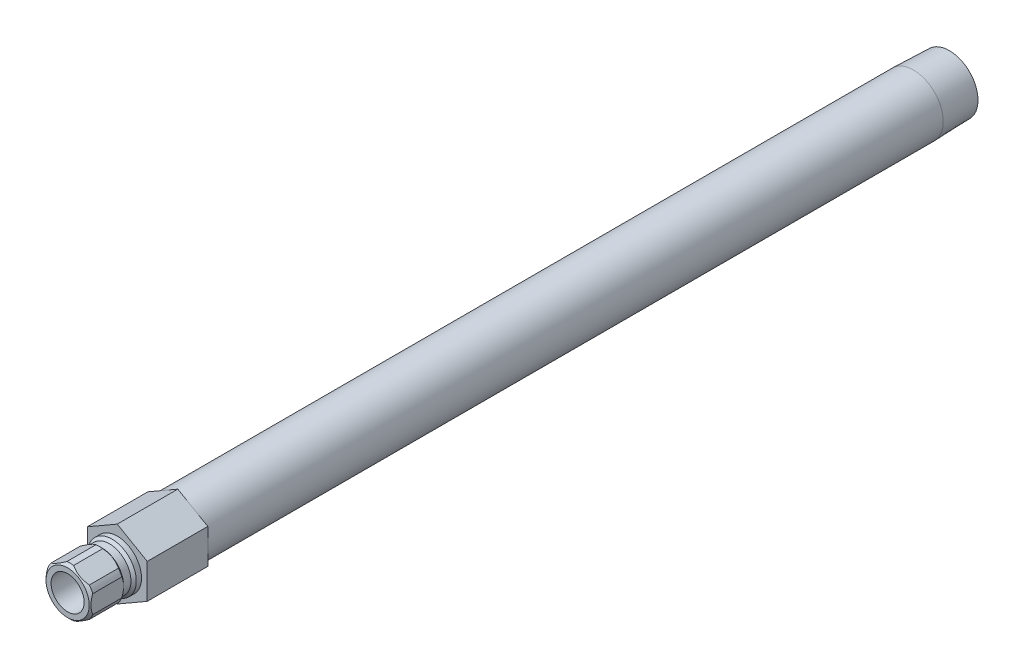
ISO-10303-21;
HEADER;
FILE_DESCRIPTION(('STEP AP214'),'2;1');
FILE_NAME('part.step','',(''),(''),'','','');
FILE_SCHEMA(('AUTOMOTIVE_DESIGN { 1 0 10303 214 1 1 1 1 }'));
ENDSEC;
DATA;
#1=APPLICATION_CONTEXT('core data for automotive mechanical design processes');
#2=APPLICATION_PROTOCOL_DEFINITION('international standard','automotive_design',2000,#1);
#3=PRODUCT_CONTEXT('',#1,'mechanical');
#4=PRODUCT('Part','Part','',(#3));
#5=PRODUCT_RELATED_PRODUCT_CATEGORY('part','',(#4));
#6=PRODUCT_DEFINITION_FORMATION('','',#4);
#7=PRODUCT_DEFINITION_CONTEXT('part definition',#1,'design');
#8=PRODUCT_DEFINITION('design','',#6,#7);
#9=PRODUCT_DEFINITION_SHAPE('','',#8);
#10=(LENGTH_UNIT() NAMED_UNIT(*) SI_UNIT(.MILLI.,.METRE.));
#11=(NAMED_UNIT(*) PLANE_ANGLE_UNIT() SI_UNIT($,.RADIAN.));
#12=(NAMED_UNIT(*) SI_UNIT($,.STERADIAN.) SOLID_ANGLE_UNIT());
#13=UNCERTAINTY_MEASURE_WITH_UNIT(LENGTH_MEASURE(1.E-05),#10,'distance_accuracy_value','');
#14=(GEOMETRIC_REPRESENTATION_CONTEXT(3) GLOBAL_UNCERTAINTY_ASSIGNED_CONTEXT((#13)) GLOBAL_UNIT_ASSIGNED_CONTEXT((#10,
#11,#12)) REPRESENTATION_CONTEXT('',''));
#15=CARTESIAN_POINT('',(0.,0.,0.));
#16=DIRECTION('',(0.,0.,1.));
#17=DIRECTION('',(1.,0.,0.));
#18=AXIS2_PLACEMENT_3D('',#15,#16,#17);
#19=CARTESIAN_POINT('',(0.,0.,0.));
#20=DIRECTION('',(0.,0.,-1.));
#21=DIRECTION('',(0.,1.,0.));
#22=AXIS2_PLACEMENT_3D('',#19,#20,#21);
#23=CYLINDRICAL_SURFACE('',#22,6.985);
#24=DIRECTION('',(0.,0.,-1.));
#25=VECTOR('',#24,1.);
#26=CARTESIAN_POINT('',(5.50323442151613,-4.30170151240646,0.));
#27=LINE('',#26,#25);
#28=CARTESIAN_POINT('',(5.50323442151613,-4.30170151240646,5.1562));
#29=VERTEX_POINT('',#28);
#30=CARTESIAN_POINT('',(5.50323442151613,-4.30170151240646,13.5382));
#31=VERTEX_POINT('',#30);
#32=EDGE_CURVE('E406',#29,#31,#27,.F.);
#33=ORIENTED_EDGE('',*,*,#32,.F.);
#34=CARTESIAN_POINT('',(0.,0.,5.1562));
#35=DIRECTION('',(0.,0.,-1.));
#36=DIRECTION('',(0.,1.,0.));
#37=AXIS2_PLACEMENT_3D('',#34,#35,#36);
#38=CIRCLE('',#37,6.985);
#39=CARTESIAN_POINT('',(6.477,-2.6150900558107,5.1562));
#40=VERTEX_POINT('',#39);
#41=EDGE_CURVE('E383',#40,#29,#38,.T.);
#42=ORIENTED_EDGE('',*,*,#41,.F.);
#43=DIRECTION('',(0.,0.,-1.));
#44=VECTOR('',#43,1.);
#45=CARTESIAN_POINT('',(6.477,-2.6150900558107,0.));
#46=LINE('',#45,#44);
#47=CARTESIAN_POINT('',(6.477,-2.6150900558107,13.5382));
#48=VERTEX_POINT('',#47);
#49=EDGE_CURVE('E397',#48,#40,#46,.T.);
#50=ORIENTED_EDGE('',*,*,#49,.F.);
#51=CARTESIAN_POINT('',(0.,0.,13.5382));
#52=DIRECTION('',(0.,0.,-1.));
#53=DIRECTION('',(0.,1.,0.));
#54=AXIS2_PLACEMENT_3D('',#51,#52,#53);
#55=CIRCLE('',#54,6.985);
#56=EDGE_CURVE('E191',#48,#31,#55,.T.);
#57=ORIENTED_EDGE('',*,*,#56,.T.);
#58=EDGE_LOOP('',(#33,#42,#50,#57));
#59=FACE_BOUND('',#58,.T.);
#60=ADVANCED_FACE('F34',(#59),#23,.T.);
#61=DIRECTION('',(0.,0.,-1.));
#62=VECTOR('',#61,1.);
#63=CARTESIAN_POINT('',(6.477,2.61509005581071,0.));
#64=LINE('',#63,#62);
#65=CARTESIAN_POINT('',(6.477,2.6150900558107,5.1562));
#66=VERTEX_POINT('',#65);
#67=CARTESIAN_POINT('',(6.477,2.61509005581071,13.5382));
#68=VERTEX_POINT('',#67);
#69=EDGE_CURVE('E309',#66,#68,#64,.F.);
#70=ORIENTED_EDGE('',*,*,#69,.F.);
#71=CARTESIAN_POINT('',(5.50323442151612,4.30170151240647,5.1562));
#72=VERTEX_POINT('',#71);
#73=EDGE_CURVE('E204',#72,#66,#38,.T.);
#74=ORIENTED_EDGE('',*,*,#73,.F.);
#75=DIRECTION('',(0.,0.,-1.));
#76=VECTOR('',#75,1.);
#77=CARTESIAN_POINT('',(5.50323442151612,4.30170151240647,0.));
#78=LINE('',#77,#76);
#79=CARTESIAN_POINT('',(5.50323442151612,4.30170151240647,13.5382));
#80=VERTEX_POINT('',#79);
#81=EDGE_CURVE('E394',#80,#72,#78,.T.);
#82=ORIENTED_EDGE('',*,*,#81,.F.);
#83=EDGE_CURVE('E198',#80,#68,#55,.T.);
#84=ORIENTED_EDGE('',*,*,#83,.T.);
#85=EDGE_LOOP('',(#70,#74,#82,#84));
#86=FACE_BOUND('',#85,.T.);
#87=ADVANCED_FACE('F343',(#86),#23,.T.);
#88=DIRECTION('',(0.,0.,-1.));
#89=VECTOR('',#88,1.);
#90=CARTESIAN_POINT('',(0.973765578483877,6.91679156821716,0.));
#91=LINE('',#90,#89);
#92=CARTESIAN_POINT('',(0.973765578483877,6.91679156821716,5.1562));
#93=VERTEX_POINT('',#92);
#94=CARTESIAN_POINT('',(0.973765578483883,6.91679156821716,13.5382));
#95=VERTEX_POINT('',#94);
#96=EDGE_CURVE('E399',#93,#95,#91,.F.);
#97=ORIENTED_EDGE('',*,*,#96,.F.);
#98=CARTESIAN_POINT('',(-0.973765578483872,6.91679156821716,5.1562));
#99=VERTEX_POINT('',#98);
#100=EDGE_CURVE('E200',#99,#93,#38,.T.);
#101=ORIENTED_EDGE('',*,*,#100,.F.);
#102=DIRECTION('',(0.,0.,-1.));
#103=VECTOR('',#102,1.);
#104=CARTESIAN_POINT('',(-0.973765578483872,6.91679156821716,0.));
#105=LINE('',#104,#103);
#106=CARTESIAN_POINT('',(-0.973765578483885,6.91679156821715,13.5382));
#107=VERTEX_POINT('',#106);
#108=EDGE_CURVE('E375',#107,#99,#105,.T.);
#109=ORIENTED_EDGE('',*,*,#108,.F.);
#110=EDGE_CURVE('E193',#107,#95,#55,.T.);
#111=ORIENTED_EDGE('',*,*,#110,.T.);
#112=EDGE_LOOP('',(#97,#101,#109,#111));
#113=FACE_BOUND('',#112,.T.);
#114=ADVANCED_FACE('F348',(#113),#23,.T.);
#115=DIRECTION('',(0.,0.,-1.));
#116=VECTOR('',#115,1.);
#117=CARTESIAN_POINT('',(-5.50323442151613,4.30170151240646,0.));
#118=LINE('',#117,#116);
#119=CARTESIAN_POINT('',(-5.50323442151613,4.30170151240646,5.1562));
#120=VERTEX_POINT('',#119);
#121=CARTESIAN_POINT('',(-5.50323442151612,4.30170151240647,13.5382));
#122=VERTEX_POINT('',#121);
#123=EDGE_CURVE('E54',#120,#122,#118,.F.);
#124=ORIENTED_EDGE('',*,*,#123,.F.);
#125=CARTESIAN_POINT('',(-6.477,2.61509005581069,5.1562));
#126=VERTEX_POINT('',#125);
#127=EDGE_CURVE('E203',#126,#120,#38,.T.);
#128=ORIENTED_EDGE('',*,*,#127,.F.);
#129=DIRECTION('',(0.,0.,-1.));
#130=VECTOR('',#129,1.);
#131=CARTESIAN_POINT('',(-6.477,2.61509005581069,0.));
#132=LINE('',#131,#130);
#133=CARTESIAN_POINT('',(-6.477,2.61509005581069,13.5382));
#134=VERTEX_POINT('',#133);
#135=EDGE_CURVE('E263',#134,#126,#132,.T.);
#136=ORIENTED_EDGE('',*,*,#135,.F.);
#137=EDGE_CURVE('E189',#134,#122,#55,.T.);
#138=ORIENTED_EDGE('',*,*,#137,.T.);
#139=EDGE_LOOP('',(#124,#128,#136,#138));
#140=FACE_BOUND('',#139,.T.);
#141=ADVANCED_FACE('F360',(#140),#23,.T.);
#142=DIRECTION('',(0.,0.,-1.));
#143=VECTOR('',#142,1.);
#144=CARTESIAN_POINT('',(-6.477,-2.61509005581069,0.));
#145=LINE('',#144,#143);
#146=CARTESIAN_POINT('',(-6.477,-2.61509005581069,5.1562));
#147=VERTEX_POINT('',#146);
#148=CARTESIAN_POINT('',(-6.477,-2.6150900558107,13.5382));
#149=VERTEX_POINT('',#148);
#150=EDGE_CURVE('E62',#147,#149,#145,.F.);
#151=ORIENTED_EDGE('',*,*,#150,.F.);
#152=CARTESIAN_POINT('',(-5.50323442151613,-4.30170151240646,5.1562));
#153=VERTEX_POINT('',#152);
#154=EDGE_CURVE('E182',#153,#147,#38,.T.);
#155=ORIENTED_EDGE('',*,*,#154,.F.);
#156=DIRECTION('',(0.,0.,-1.));
#157=VECTOR('',#156,1.);
#158=CARTESIAN_POINT('',(-5.50323442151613,-4.30170151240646,0.));
#159=LINE('',#158,#157);
#160=CARTESIAN_POINT('',(-5.50323442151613,-4.30170151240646,13.5382));
#161=VERTEX_POINT('',#160);
#162=EDGE_CURVE('E165',#161,#153,#159,.T.);
#163=ORIENTED_EDGE('',*,*,#162,.F.);
#164=EDGE_CURVE('E180',#161,#149,#55,.T.);
#165=ORIENTED_EDGE('',*,*,#164,.T.);
#166=EDGE_LOOP('',(#151,#155,#163,#165));
#167=FACE_BOUND('',#166,.T.);
#168=ADVANCED_FACE('F179',(#167),#23,.T.);
#169=CARTESIAN_POINT('',(0.,0.,0.));
#170=DIRECTION('',(0.,0.,-1.));
#171=DIRECTION('',(0.,1.,0.));
#172=AXIS2_PLACEMENT_3D('',#169,#170,#171);
#173=CYLINDRICAL_SURFACE('',#172,8.57249999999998);
#174=CARTESIAN_POINT('',(0.,0.,-229.362));
#175=DIRECTION('',(0.,0.,-1.));
#176=DIRECTION('',(0.,1.,0.));
#177=AXIS2_PLACEMENT_3D('',#174,#175,#176);
#178=CIRCLE('',#177,8.57249999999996);
#179=CARTESIAN_POINT('',(0.,8.5725,-229.362));
#180=VERTEX_POINT('',#179);
#181=EDGE_CURVE('E214',#180,#180,#178,.T.);
#182=ORIENTED_EDGE('',*,*,#181,.F.);
#183=EDGE_LOOP('',(#182));
#184=FACE_BOUND('',#183,.T.);
#185=CARTESIAN_POINT('',(0.,0.,-17.4498));
#186=DIRECTION('',(0.,0.,1.));
#187=DIRECTION('',(1.,0.,0.));
#188=AXIS2_PLACEMENT_3D('',#185,#186,#187);
#189=CIRCLE('',#188,8.57249999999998);
#190=CARTESIAN_POINT('',(8.57249999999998,0.,-17.4498));
#191=VERTEX_POINT('',#190);
#192=EDGE_CURVE('E231',#191,#191,#189,.F.);
#193=ORIENTED_EDGE('',*,*,#192,.T.);
#194=EDGE_LOOP('',(#193));
#195=FACE_BOUND('',#194,.T.);
#196=ADVANCED_FACE('F359',(#184,#195),#173,.T.);
#197=CARTESIAN_POINT('',(0.,0.,0.));
#198=DIRECTION('',(0.,0.,-1.));
#199=DIRECTION('',(0.,1.,0.));
#200=AXIS2_PLACEMENT_3D('',#197,#198,#199);
#201=CYLINDRICAL_SURFACE('',#200,4.76249999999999);
#202=CARTESIAN_POINT('',(0.,0.,14.3002));
#203=DIRECTION('',(0.,0.,-1.));
#204=DIRECTION('',(0.,1.,0.));
#205=AXIS2_PLACEMENT_3D('',#202,#203,#204);
#206=CIRCLE('',#205,4.7625);
#207=CARTESIAN_POINT('',(0.,4.7625,14.3002));
#208=VERTEX_POINT('',#207);
#209=EDGE_CURVE('E233',#208,#208,#206,.T.);
#210=ORIENTED_EDGE('',*,*,#209,.F.);
#211=EDGE_LOOP('',(#210));
#212=FACE_BOUND('',#211,.T.);
#213=CARTESIAN_POINT('',(0.,0.,-17.4498));
#214=DIRECTION('',(0.,0.,-1.));
#215=DIRECTION('',(0.,1.,0.));
#216=AXIS2_PLACEMENT_3D('',#213,#214,#215);
#217=CIRCLE('',#216,4.76249999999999);
#218=CARTESIAN_POINT('',(0.,4.7625,-17.4498));
#219=VERTEX_POINT('',#218);
#220=EDGE_CURVE('E226',#219,#219,#217,.T.);
#221=ORIENTED_EDGE('',*,*,#220,.T.);
#222=EDGE_LOOP('',(#221));
#223=FACE_BOUND('',#222,.T.);
#224=ADVANCED_FACE('F36',(#212,#223),#201,.F.);
#225=CARTESIAN_POINT('',(0.,4.7625,-17.4498));
#226=DIRECTION('',(0.,0.,-1.));
#227=DIRECTION('',(0.,1.,0.));
#228=AXIS2_PLACEMENT_3D('',#225,#226,#227);
#229=PLANE('',#228);
#230=CARTESIAN_POINT('',(0.,0.,-17.4498));
#231=DIRECTION('',(0.,0.,-1.));
#232=DIRECTION('',(0.,1.,0.));
#233=AXIS2_PLACEMENT_3D('',#230,#231,#232);
#234=CIRCLE('',#233,6.26109999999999);
#235=CARTESIAN_POINT('',(0.,6.2611,-17.4498));
#236=VERTEX_POINT('',#235);
#237=EDGE_CURVE('E223',#236,#236,#234,.T.);
#238=ORIENTED_EDGE('',*,*,#237,.T.);
#239=EDGE_LOOP('',(#238));
#240=FACE_BOUND('',#239,.T.);
#241=ORIENTED_EDGE('',*,*,#220,.F.);
#242=EDGE_LOOP('',(#241));
#243=FACE_BOUND('',#242,.T.);
#244=ADVANCED_FACE('F687',(#240,#243),#229,.T.);
#245=CARTESIAN_POINT('',(0.,0.,0.));
#246=DIRECTION('',(0.,0.,-1.));
#247=DIRECTION('',(0.,1.,0.));
#248=AXIS2_PLACEMENT_3D('',#245,#246,#247);
#249=CYLINDRICAL_SURFACE('',#248,6.26109999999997);
#250=CARTESIAN_POINT('',(0.,0.,-239.6998));
#251=DIRECTION('',(0.,0.,-1.));
#252=DIRECTION('',(0.,1.,0.));
#253=AXIS2_PLACEMENT_3D('',#250,#251,#252);
#254=CIRCLE('',#253,6.26109999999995);
#255=CARTESIAN_POINT('',(0.,6.2611,-239.6998));
#256=VERTEX_POINT('',#255);
#257=EDGE_CURVE('E220',#256,#256,#254,.T.);
#258=ORIENTED_EDGE('',*,*,#257,.T.);
#259=EDGE_LOOP('',(#258));
#260=FACE_BOUND('',#259,.T.);
#261=ORIENTED_EDGE('',*,*,#237,.F.);
#262=EDGE_LOOP('',(#261));
#263=FACE_BOUND('',#262,.T.);
#264=ADVANCED_FACE('F678',(#260,#263),#249,.F.);
#265=CARTESIAN_POINT('',(0.,8.24944566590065,-239.6998));
#266=DIRECTION('',(0.,0.,-1.));
#267=DIRECTION('',(0.,1.,0.));
#268=AXIS2_PLACEMENT_3D('',#265,#266,#267);
#269=PLANE('',#268);
#270=CARTESIAN_POINT('',(0.,0.,-239.6998));
#271=DIRECTION('',(0.,0.,-1.));
#272=DIRECTION('',(0.,1.,0.));
#273=AXIS2_PLACEMENT_3D('',#270,#271,#272);
#274=CIRCLE('',#273,8.2494456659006);
#275=CARTESIAN_POINT('',(0.,8.24944566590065,-239.6998));
#276=VERTEX_POINT('',#275);
#277=EDGE_CURVE('E217',#276,#276,#274,.T.);
#278=ORIENTED_EDGE('',*,*,#277,.T.);
#279=EDGE_LOOP('',(#278));
#280=FACE_BOUND('',#279,.T.);
#281=ORIENTED_EDGE('',*,*,#257,.F.);
#282=EDGE_LOOP('',(#281));
#283=FACE_BOUND('',#282,.T.);
#284=ADVANCED_FACE('F669',(#280,#283),#269,.T.);
#285=CARTESIAN_POINT('',(0.,0.,-239.6998));
#286=DIRECTION('',(0.,0.,1.));
#287=DIRECTION('',(0.,-1.,0.));
#288=AXIS2_PLACEMENT_3D('',#285,#286,#287);
#289=CONICAL_SURFACE('',#288,8.2494456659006,0.0312396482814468);
#290=ORIENTED_EDGE('',*,*,#181,.T.);
#291=EDGE_LOOP('',(#290));
#292=FACE_BOUND('',#291,.T.);
#293=ORIENTED_EDGE('',*,*,#277,.F.);
#294=EDGE_LOOP('',(#293));
#295=FACE_BOUND('',#294,.T.);
#296=ADVANCED_FACE('F661',(#292,#295),#289,.T.);
#297=CARTESIAN_POINT('',(0.,0.,0.));
#298=DIRECTION('',(0.,0.,-1.));
#299=DIRECTION('',(0.,1.,0.));
#300=AXIS2_PLACEMENT_3D('',#297,#298,#299);
#301=CYLINDRICAL_SURFACE('',#300,6.985);
#302=CARTESIAN_POINT('',(0.,0.,0.));
#303=DIRECTION('',(0.,0.,1.));
#304=DIRECTION('',(1.,0.,0.));
#305=AXIS2_PLACEMENT_3D('',#302,#303,#304);
#306=CIRCLE('',#305,6.985);
#307=CARTESIAN_POINT('',(6.985,0.,0.));
#308=VERTEX_POINT('',#307);
#309=EDGE_CURVE('E174',#308,#308,#306,.F.);
#310=ORIENTED_EDGE('',*,*,#309,.F.);
#311=EDGE_LOOP('',(#310));
#312=FACE_BOUND('',#311,.T.);
#313=CARTESIAN_POINT('',(0.,0.,1.50875999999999));
#314=DIRECTION('',(0.,0.,-1.));
#315=DIRECTION('',(0.,1.,0.));
#316=AXIS2_PLACEMENT_3D('',#313,#314,#315);
#317=CIRCLE('',#316,6.985);
#318=CARTESIAN_POINT('',(0.,6.985,1.50876));
#319=VERTEX_POINT('',#318);
#320=EDGE_CURVE('E211',#319,#319,#317,.T.);
#321=ORIENTED_EDGE('',*,*,#320,.T.);
#322=EDGE_LOOP('',(#321));
#323=FACE_BOUND('',#322,.T.);
#324=ADVANCED_FACE('F653',(#312,#323),#301,.T.);
#325=CARTESIAN_POINT('',(0.,0.,1.50875999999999));
#326=DIRECTION('',(0.,0.,-1.));
#327=DIRECTION('',(0.,1.,0.));
#328=AXIS2_PLACEMENT_3D('',#325,#326,#327);
#329=CONICAL_SURFACE('',#328,6.985,0.785398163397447);
#330=CARTESIAN_POINT('',(0.,0.,2.27076));
#331=DIRECTION('',(0.,0.,-1.));
#332=DIRECTION('',(0.,1.,0.));
#333=AXIS2_PLACEMENT_3D('',#330,#331,#332);
#334=CIRCLE('',#333,6.223);
#335=CARTESIAN_POINT('',(0.,6.223,2.27076));
#336=VERTEX_POINT('',#335);
#337=EDGE_CURVE('E208',#336,#336,#334,.T.);
#338=ORIENTED_EDGE('',*,*,#337,.T.);
#339=EDGE_LOOP('',(#338));
#340=FACE_BOUND('',#339,.T.);
#341=ORIENTED_EDGE('',*,*,#320,.F.);
#342=EDGE_LOOP('',(#341));
#343=FACE_BOUND('',#342,.T.);
#344=ADVANCED_FACE('F645',(#340,#343),#329,.T.);
#345=CARTESIAN_POINT('',(0.,0.,0.));
#346=DIRECTION('',(0.,0.,-1.));
#347=DIRECTION('',(0.,1.,0.));
#348=AXIS2_PLACEMENT_3D('',#345,#346,#347);
#349=CYLINDRICAL_SURFACE('',#348,6.223);
#350=CARTESIAN_POINT('',(0.,0.,4.3942));
#351=DIRECTION('',(0.,0.,-1.));
#352=DIRECTION('',(0.,1.,0.));
#353=AXIS2_PLACEMENT_3D('',#350,#351,#352);
#354=CIRCLE('',#353,6.223);
#355=CARTESIAN_POINT('',(0.,6.223,4.3942));
#356=VERTEX_POINT('',#355);
#357=EDGE_CURVE('E205',#356,#356,#354,.T.);
#358=ORIENTED_EDGE('',*,*,#357,.T.);
#359=EDGE_LOOP('',(#358));
#360=FACE_BOUND('',#359,.T.);
#361=ORIENTED_EDGE('',*,*,#337,.F.);
#362=EDGE_LOOP('',(#361));
#363=FACE_BOUND('',#362,.T.);
#364=ADVANCED_FACE('F270',(#360,#363),#349,.T.);
#365=CARTESIAN_POINT('',(0.,0.,4.3942));
#366=DIRECTION('',(0.,0.,1.));
#367=DIRECTION('',(0.,-1.,0.));
#368=AXIS2_PLACEMENT_3D('',#365,#366,#367);
#369=CONICAL_SURFACE('',#368,6.223,0.785398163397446);
#370=CARTESIAN_POINT('',(0.973302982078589,-6.91705864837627,5.1564));
#371=CARTESIAN_POINT('',(1.1543052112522,-6.81255696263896,5.07808330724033));
#372=CARTESIAN_POINT('',(1.3378209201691,-6.70660411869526,5.00684558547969));
#373=CARTESIAN_POINT('',(1.70963160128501,-6.49193912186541,4.88134753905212));
#374=CARTESIAN_POINT('',(1.89793754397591,-6.38322063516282,4.82713086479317));
#375=CARTESIAN_POINT('',(2.27146153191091,-6.16756646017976,4.74047563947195));
#376=CARTESIAN_POINT('',(2.45655498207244,-6.06070270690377,4.70733772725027));
#377=CARTESIAN_POINT('',(2.82844640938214,-5.8459910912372,4.66198043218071));
#378=CARTESIAN_POINT('',(3.0152419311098,-5.73814464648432,4.64973461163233));
#379=CARTESIAN_POINT('',(3.3948057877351,-5.51900335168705,4.64689437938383));
#380=CARTESIAN_POINT('',(3.58757842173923,-5.40770601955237,4.65698827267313));
#381=CARTESIAN_POINT('',(3.97148128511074,-5.18605959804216,4.69952919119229));
#382=CARTESIAN_POINT('',(4.1626089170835,-5.07571200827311,4.73200667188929));
#383=CARTESIAN_POINT('',(4.54854122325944,-4.85289388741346,4.81877263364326));
#384=CARTESIAN_POINT('',(4.74321398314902,-4.74049951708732,4.87383522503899));
#385=CARTESIAN_POINT('',(5.03141021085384,-4.57410934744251,4.97019209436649));
#386=CARTESIAN_POINT('',(5.12673323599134,-4.51907457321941,5.00455772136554));
#387=CARTESIAN_POINT('',(5.31613879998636,-4.40972121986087,5.07745547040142));
#388=CARTESIAN_POINT('',(5.41022179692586,-4.35540237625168,5.11598600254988));
#389=CARTESIAN_POINT('',(5.5036970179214,-4.30143443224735,5.1564));
#390=B_SPLINE_CURVE_WITH_KNOTS('',3,(#370,#371,#372,#373,#374,#375,#376,#377,#378,#379,#380,
#381,#382,#383,#384,#385,#386,#387,#388,#389),.UNSPECIFIED.,.F.,.F.,(4,2,2,2,2,2,2,2,2,4),(0.,
0.669810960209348,1.34132587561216,1.9892054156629,2.63626449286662,3.3035366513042,
3.9717185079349,4.66502165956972,5.01088265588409,5.35661208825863),.UNSPECIFIED.);
#391=CARTESIAN_POINT('',(0.973765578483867,-6.91679156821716,5.1562));
#392=VERTEX_POINT('',#391);
#393=EDGE_CURVE('E408',#392,#29,#390,.T.);
#394=ORIENTED_EDGE('',*,*,#393,.F.);
#395=CARTESIAN_POINT('',(-0.973765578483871,-6.91679156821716,5.1562));
#396=VERTEX_POINT('',#395);
#397=EDGE_CURVE('E381',#392,#396,#38,.T.);
#398=ORIENTED_EDGE('',*,*,#397,.T.);
#399=CARTESIAN_POINT('',(-5.50369701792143,-4.30143443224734,5.15640000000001));
#400=CARTESIAN_POINT('',(-5.32269478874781,-4.40593611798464,5.07808330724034));
#401=CARTESIAN_POINT('',(-5.13917907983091,-4.51188896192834,5.0068455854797));
#402=CARTESIAN_POINT('',(-4.767368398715,-4.72655395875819,4.88134753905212));
#403=CARTESIAN_POINT('',(-4.5790624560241,-4.83527244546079,4.82713086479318));
#404=CARTESIAN_POINT('',(-4.2055384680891,-5.05092662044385,4.74047563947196));
#405=CARTESIAN_POINT('',(-4.02044501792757,-5.15779037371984,4.70733772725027));
#406=CARTESIAN_POINT('',(-3.64855359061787,-5.37250198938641,4.66198043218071));
#407=CARTESIAN_POINT('',(-3.46175806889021,-5.48034843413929,4.64973461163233));
#408=CARTESIAN_POINT('',(-3.08219421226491,-5.69948972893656,4.64689437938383));
#409=CARTESIAN_POINT('',(-2.88942157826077,-5.81078706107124,4.65698827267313));
#410=CARTESIAN_POINT('',(-2.50551871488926,-6.03243348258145,4.69952919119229));
#411=CARTESIAN_POINT('',(-2.3143910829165,-6.1427810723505,4.73200667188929));
#412=CARTESIAN_POINT('',(-1.92845877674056,-6.36559919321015,4.81877263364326));
#413=CARTESIAN_POINT('',(-1.73378601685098,-6.47799356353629,4.87383522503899));
#414=CARTESIAN_POINT('',(-1.44558978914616,-6.6443837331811,4.97019209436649));
#415=CARTESIAN_POINT('',(-1.35026676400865,-6.69941850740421,5.00455772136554));
#416=CARTESIAN_POINT('',(-1.16086120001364,-6.80877186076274,5.07745547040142));
#417=CARTESIAN_POINT('',(-1.06677820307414,-6.86309070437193,5.11598600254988));
#418=CARTESIAN_POINT('',(-0.973302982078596,-6.91705864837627,5.1564));
#419=B_SPLINE_CURVE_WITH_KNOTS('',3,(#399,#400,#401,#402,#403,#404,#405,#406,#407,#408,#409,
#410,#411,#412,#413,#414,#415,#416,#417,#418),.UNSPECIFIED.,.F.,.F.,(4,2,2,2,2,2,2,2,2,4),(0.,
0.669810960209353,1.34132587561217,1.98920541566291,2.63626449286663,3.30353665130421,
3.97171850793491,4.66502165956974,5.01088265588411,5.35661208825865),.UNSPECIFIED.);
#420=EDGE_CURVE('E256',#153,#396,#419,.T.);
#421=ORIENTED_EDGE('',*,*,#420,.F.);
#422=ORIENTED_EDGE('',*,*,#154,.T.);
#423=CARTESIAN_POINT('',(-6.477,-7.50531717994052,8.08489330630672));
#424=CARTESIAN_POINT('',(-6.477,-7.32278230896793,7.94673378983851));
#425=CARTESIAN_POINT('',(-6.477,-7.13923073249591,7.80989578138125));
#426=CARTESIAN_POINT('',(-6.477,-6.76969107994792,7.53945615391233));
#427=CARTESIAN_POINT('',(-6.477,-6.58370240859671,7.40585534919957));
#428=CARTESIAN_POINT('',(-6.477,-6.20752484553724,7.14153325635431));
#429=CARTESIAN_POINT('',(-6.477,-6.01731457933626,7.01084228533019));
#430=CARTESIAN_POINT('',(-6.477,-5.63367369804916,6.75429124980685));
#431=CARTESIAN_POINT('',(-6.477,-5.44024331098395,6.62843084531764));
#432=CARTESIAN_POINT('',(-6.477,-5.03831720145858,6.37548971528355));
#433=CARTESIAN_POINT('',(-6.477,-4.82959841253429,6.24876164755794));
#434=CARTESIAN_POINT('',(-6.477,-4.40728395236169,6.00357587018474));
#435=CARTESIAN_POINT('',(-6.477,-4.19368750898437,5.88511948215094));
#436=CARTESIAN_POINT('',(-6.477,-3.7616267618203,5.6590284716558));
#437=CARTESIAN_POINT('',(-6.477,-3.54317924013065,5.55136202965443));
#438=CARTESIAN_POINT('',(-6.477,-3.100295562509,5.34926153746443));
#439=CARTESIAN_POINT('',(-6.477,-2.87586219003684,5.25482146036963));
#440=CARTESIAN_POINT('',(-6.477,-2.43955826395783,5.0897033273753));
#441=CARTESIAN_POINT('',(-6.477,-2.22819339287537,5.0177028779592));
#442=CARTESIAN_POINT('',(-6.477,-1.80033354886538,4.8906524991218));
#443=CARTESIAN_POINT('',(-6.477,-1.58383822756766,4.8356037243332));
#444=CARTESIAN_POINT('',(-6.477,-1.15063390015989,4.74626140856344));
#445=CARTESIAN_POINT('',(-6.477,-0.934000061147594,4.7116093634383));
#446=CARTESIAN_POINT('',(-6.477,-0.498364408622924,4.66374056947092));
#447=CARTESIAN_POINT('',(-6.477,-0.279363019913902,4.65052003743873));
#448=CARTESIAN_POINT('',(-6.477,0.15069719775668,4.64651642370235));
#449=CARTESIAN_POINT('',(-6.477,0.361748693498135,4.65491764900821));
#450=CARTESIAN_POINT('',(-6.477,0.782066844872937,4.69188275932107));
#451=CARTESIAN_POINT('',(-6.477,0.991333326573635,4.72044858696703));
#452=CARTESIAN_POINT('',(-6.477,1.41010575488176,4.79666246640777));
#453=CARTESIAN_POINT('',(-6.477,1.61955133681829,4.84463689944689));
#454=CARTESIAN_POINT('',(-6.477,2.03387291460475,4.95709535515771));
#455=CARTESIAN_POINT('',(-6.477,2.2387492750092,5.0215780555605));
#456=CARTESIAN_POINT('',(-6.477,2.66141718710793,5.17064013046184));
#457=CARTESIAN_POINT('',(-6.477,2.87875617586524,5.25648961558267));
#458=CARTESIAN_POINT('',(-6.477,3.30779766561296,5.44138196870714));
#459=CARTESIAN_POINT('',(-6.477,3.51949749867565,5.54043095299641));
#460=CARTESIAN_POINT('',(-6.477,3.93828980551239,5.74936705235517));
#461=CARTESIAN_POINT('',(-6.477,4.14536521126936,5.85928810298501));
#462=CARTESIAN_POINT('',(-6.477,4.55475391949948,6.08754039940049));
#463=CARTESIAN_POINT('',(-6.477,4.75706796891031,6.20587031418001));
#464=CARTESIAN_POINT('',(-6.477,5.14761370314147,6.44323908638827));
#465=CARTESIAN_POINT('',(-6.477,5.33604552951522,6.56195038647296));
#466=CARTESIAN_POINT('',(-6.477,5.7096738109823,6.80437488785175));
#467=CARTESIAN_POINT('',(-6.477,5.89487001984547,6.92808846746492));
#468=CARTESIAN_POINT('',(-6.477,6.26095063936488,7.17860412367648));
#469=CARTESIAN_POINT('',(-6.477,6.44185783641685,7.3053730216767));
#470=CARTESIAN_POINT('',(-6.477,6.8011983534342,7.56227065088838));
#471=CARTESIAN_POINT('',(-6.477,6.97963234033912,7.69239844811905));
#472=CARTESIAN_POINT('',(-6.477,7.15703038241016,7.82389977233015));
#473=B_SPLINE_CURVE_WITH_KNOTS('',3,(#423,#424,#425,#426,#427,#428,#429,#430,#431,#432,#433,
#434,#435,#436,#437,#438,#439,#440,#441,#442,#443,#444,#445,#446,#447,#448,#449,#450,#451,#452,
#453,#454,#455,#456,#457,#458,#459,#460,#461,#462,#463,#464,#465,#466,#467,#468,#469,#470,#471,
#472),.UNSPECIFIED.,.F.,.F.,(4,2,2,2,2,2,2,2,2,2,2,2,2,2,2,2,2,2,2,2,2,2,2,2,4),(0.,
0.686790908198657,1.37375281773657,2.06603541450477,2.75826919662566,3.49065471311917,
4.22315698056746,4.95343127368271,5.68337170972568,6.352659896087,7.02199365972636,
7.67918147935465,8.33625327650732,8.96890298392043,9.60161364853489,10.2454384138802,
10.8892116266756,11.5897073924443,12.2905288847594,12.9936114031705,13.6965828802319,
14.3646145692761,15.0326968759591,15.6953618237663,16.3578444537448),.UNSPECIFIED.);
#474=EDGE_CURVE('E279',#126,#147,#473,.F.);
#475=ORIENTED_EDGE('',*,*,#474,.F.);
#476=ORIENTED_EDGE('',*,*,#127,.T.);
#477=CARTESIAN_POINT('',(-0.973302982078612,6.91705864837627,5.1564));
#478=CARTESIAN_POINT('',(-1.15430521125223,6.81255696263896,5.07808330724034));
#479=CARTESIAN_POINT('',(-1.33782092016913,6.70660411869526,5.0068455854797));
#480=CARTESIAN_POINT('',(-1.70963160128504,6.49193912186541,4.88134753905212));
#481=CARTESIAN_POINT('',(-1.89793754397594,6.38322063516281,4.82713086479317));
#482=CARTESIAN_POINT('',(-2.27146153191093,6.16756646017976,4.74047563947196));
#483=CARTESIAN_POINT('',(-2.45655498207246,6.06070270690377,4.70733772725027));
#484=CARTESIAN_POINT('',(-2.82844640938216,5.8459910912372,4.66198043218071));
#485=CARTESIAN_POINT('',(-3.01524193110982,5.73814464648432,4.64973461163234));
#486=CARTESIAN_POINT('',(-3.39480578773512,5.51900335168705,4.64689437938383));
#487=CARTESIAN_POINT('',(-3.58757842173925,5.40770601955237,4.65698827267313));
#488=CARTESIAN_POINT('',(-3.97148128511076,5.18605959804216,4.6995291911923));
#489=CARTESIAN_POINT('',(-4.16260891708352,5.07571200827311,4.7320066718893));
#490=CARTESIAN_POINT('',(-4.54854122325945,4.85289388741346,4.81877263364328));
#491=CARTESIAN_POINT('',(-4.74321398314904,4.74049951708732,4.873835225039));
#492=CARTESIAN_POINT('',(-5.03141021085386,4.57410934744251,4.9701920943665));
#493=CARTESIAN_POINT('',(-5.12673323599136,4.51907457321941,5.00455772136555));
#494=CARTESIAN_POINT('',(-5.31613879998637,4.40972121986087,5.07745547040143));
#495=CARTESIAN_POINT('',(-5.41022179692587,4.35540237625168,5.11598600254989));
#496=CARTESIAN_POINT('',(-5.50369701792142,4.30143443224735,5.15640000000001));
#497=B_SPLINE_CURVE_WITH_KNOTS('',3,(#477,#478,#479,#480,#481,#482,#483,#484,#485,#486,#487,
#488,#489,#490,#491,#492,#493,#494,#495,#496),.UNSPECIFIED.,.F.,.F.,(4,2,2,2,2,2,2,2,2,4),(0.,
0.669810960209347,1.34132587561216,1.9892054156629,2.63626449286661,3.30353665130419,
3.97171850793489,4.66502165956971,5.01088265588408,5.35661208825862),.UNSPECIFIED.);
#498=EDGE_CURVE('E286',#99,#120,#497,.T.);
#499=ORIENTED_EDGE('',*,*,#498,.F.);
#500=ORIENTED_EDGE('',*,*,#100,.T.);
#501=CARTESIAN_POINT('',(5.50369701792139,4.30143443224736,5.1564));
#502=CARTESIAN_POINT('',(5.32269478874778,4.40593611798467,5.07808330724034));
#503=CARTESIAN_POINT('',(5.13917907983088,4.51188896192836,5.00684558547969));
#504=CARTESIAN_POINT('',(4.76736839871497,4.72655395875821,4.88134753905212));
#505=CARTESIAN_POINT('',(4.57906245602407,4.83527244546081,4.82713086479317));
#506=CARTESIAN_POINT('',(4.20553846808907,5.05092662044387,4.74047563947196));
#507=CARTESIAN_POINT('',(4.02044501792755,5.15779037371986,4.70733772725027));
#508=CARTESIAN_POINT('',(3.64855359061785,5.37250198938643,4.66198043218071));
#509=CARTESIAN_POINT('',(3.46175806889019,5.48034843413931,4.64973461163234));
#510=CARTESIAN_POINT('',(3.08219421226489,5.69948972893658,4.64689437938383));
#511=CARTESIAN_POINT('',(2.88942157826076,5.81078706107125,4.65698827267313));
#512=CARTESIAN_POINT('',(2.50551871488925,6.03243348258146,4.6995291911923));
#513=CARTESIAN_POINT('',(2.3143910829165,6.14278107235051,4.7320066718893));
#514=CARTESIAN_POINT('',(1.92845877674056,6.36559919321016,4.81877263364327));
#515=CARTESIAN_POINT('',(1.73378601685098,6.47799356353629,4.873835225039));
#516=CARTESIAN_POINT('',(1.44558978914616,6.6443837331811,4.97019209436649));
#517=CARTESIAN_POINT('',(1.35026676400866,6.69941850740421,5.00455772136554));
#518=CARTESIAN_POINT('',(1.16086120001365,6.80877186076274,5.07745547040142));
#519=CARTESIAN_POINT('',(1.06677820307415,6.86309070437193,5.11598600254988));
#520=CARTESIAN_POINT('',(0.973302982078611,6.91705864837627,5.1564));
#521=B_SPLINE_CURVE_WITH_KNOTS('',3,(#501,#502,#503,#504,#505,#506,#507,#508,#509,#510,#511,
#512,#513,#514,#515,#516,#517,#518,#519,#520),.UNSPECIFIED.,.F.,.F.,(4,2,2,2,2,2,2,2,2,4),(0.,
0.669810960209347,1.34132587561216,1.9892054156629,2.63626449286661,3.30353665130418,
3.97171850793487,4.66502165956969,5.01088265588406,5.35661208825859),.UNSPECIFIED.);
#522=EDGE_CURVE('E293',#72,#93,#521,.T.);
#523=ORIENTED_EDGE('',*,*,#522,.F.);
#524=ORIENTED_EDGE('',*,*,#73,.T.);
#525=CARTESIAN_POINT('',(6.477,-7.50531717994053,8.08489330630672));
#526=CARTESIAN_POINT('',(6.477,-7.32278230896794,7.94673378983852));
#527=CARTESIAN_POINT('',(6.477,-7.13923073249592,7.80989578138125));
#528=CARTESIAN_POINT('',(6.477,-6.76969107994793,7.53945615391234));
#529=CARTESIAN_POINT('',(6.477,-6.58370240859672,7.40585534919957));
#530=CARTESIAN_POINT('',(6.477,-6.20752484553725,7.14153325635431));
#531=CARTESIAN_POINT('',(6.477,-6.01731457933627,7.01084228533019));
#532=CARTESIAN_POINT('',(6.477,-5.63367369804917,6.75429124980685));
#533=CARTESIAN_POINT('',(6.477,-5.44024331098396,6.62843084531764));
#534=CARTESIAN_POINT('',(6.477,-5.03831720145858,6.37548971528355));
#535=CARTESIAN_POINT('',(6.477,-4.8295984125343,6.24876164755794));
#536=CARTESIAN_POINT('',(6.477,-4.4072839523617,6.00357587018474));
#537=CARTESIAN_POINT('',(6.477,-4.19368750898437,5.88511948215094));
#538=CARTESIAN_POINT('',(6.477,-3.7616267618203,5.6590284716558));
#539=CARTESIAN_POINT('',(6.477,-3.54317924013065,5.55136202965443));
#540=CARTESIAN_POINT('',(6.477,-3.100295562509,5.34926153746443));
#541=CARTESIAN_POINT('',(6.477,-2.87586219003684,5.25482146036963));
#542=CARTESIAN_POINT('',(6.477,-2.43955826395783,5.0897033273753));
#543=CARTESIAN_POINT('',(6.477,-2.22819339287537,5.0177028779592));
#544=CARTESIAN_POINT('',(6.477,-1.80033354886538,4.89065249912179));
#545=CARTESIAN_POINT('',(6.477,-1.58383822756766,4.8356037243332));
#546=CARTESIAN_POINT('',(6.477,-1.15063390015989,4.74626140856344));
#547=CARTESIAN_POINT('',(6.477,-0.934000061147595,4.71160936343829));
#548=CARTESIAN_POINT('',(6.477,-0.498364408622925,4.66374056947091));
#549=CARTESIAN_POINT('',(6.477,-0.279363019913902,4.65052003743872));
#550=CARTESIAN_POINT('',(6.477,0.150697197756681,4.64651642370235));
#551=CARTESIAN_POINT('',(6.477,0.361748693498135,4.6549176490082));
#552=CARTESIAN_POINT('',(6.477,0.782066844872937,4.69188275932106));
#553=CARTESIAN_POINT('',(6.477,0.991333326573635,4.72044858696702));
#554=CARTESIAN_POINT('',(6.477,1.41010575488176,4.79666246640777));
#555=CARTESIAN_POINT('',(6.477,1.6195513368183,4.84463689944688));
#556=CARTESIAN_POINT('',(6.477,2.03387291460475,4.95709535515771));
#557=CARTESIAN_POINT('',(6.477,2.2387492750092,5.02157805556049));
#558=CARTESIAN_POINT('',(6.477,2.66141718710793,5.17064013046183));
#559=CARTESIAN_POINT('',(6.477,2.87875617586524,5.25648961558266));
#560=CARTESIAN_POINT('',(6.477,3.30779766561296,5.44138196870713));
#561=CARTESIAN_POINT('',(6.477,3.51949749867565,5.54043095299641));
#562=CARTESIAN_POINT('',(6.477,3.93828980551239,5.74936705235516));
#563=CARTESIAN_POINT('',(6.477,4.14536521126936,5.859288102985));
#564=CARTESIAN_POINT('',(6.477,4.55475391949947,6.08754039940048));
#565=CARTESIAN_POINT('',(6.477,4.75706796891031,6.20587031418));
#566=CARTESIAN_POINT('',(6.477,5.14761370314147,6.44323908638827));
#567=CARTESIAN_POINT('',(6.477,5.33604552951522,6.56195038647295));
#568=CARTESIAN_POINT('',(6.477,5.7096738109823,6.80437488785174));
#569=CARTESIAN_POINT('',(6.477,5.89487001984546,6.92808846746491));
#570=CARTESIAN_POINT('',(6.477,6.26095063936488,7.17860412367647));
#571=CARTESIAN_POINT('',(6.477,6.44185783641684,7.3053730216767));
#572=CARTESIAN_POINT('',(6.477,6.80119835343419,7.56227065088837));
#573=CARTESIAN_POINT('',(6.477,6.97963234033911,7.69239844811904));
#574=CARTESIAN_POINT('',(6.477,7.15703038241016,7.82389977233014));
#575=B_SPLINE_CURVE_WITH_KNOTS('',3,(#525,#526,#527,#528,#529,#530,#531,#532,#533,#534,#535,
#536,#537,#538,#539,#540,#541,#542,#543,#544,#545,#546,#547,#548,#549,#550,#551,#552,#553,#554,
#555,#556,#557,#558,#559,#560,#561,#562,#563,#564,#565,#566,#567,#568,#569,#570,#571,#572,#573,
#574),.UNSPECIFIED.,.F.,.F.,(4,2,2,2,2,2,2,2,2,2,2,2,2,2,2,2,2,2,2,2,2,2,2,2,4),(0.,
0.686790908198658,1.37375281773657,2.06603541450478,2.75826919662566,3.49065471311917,
4.22315698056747,4.95343127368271,5.68337170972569,6.35265989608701,7.02199365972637,
7.67918147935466,8.33625327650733,8.96890298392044,9.6016136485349,10.2454384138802,
10.8892116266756,11.5897073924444,12.2905288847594,12.9936114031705,13.6965828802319,
14.3646145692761,15.0326968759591,15.6953618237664,16.3578444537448),.UNSPECIFIED.);
#576=EDGE_CURVE('E301',#40,#66,#575,.T.);
#577=ORIENTED_EDGE('',*,*,#576,.F.);
#578=ORIENTED_EDGE('',*,*,#41,.T.);
#579=EDGE_LOOP('',(#394,#398,#421,#422,#475,#476,#499,#500,#523,#524,#577,#578));
#580=FACE_BOUND('',#579,.T.);
#581=ORIENTED_EDGE('',*,*,#357,.F.);
#582=EDGE_LOOP('',(#581));
#583=FACE_BOUND('',#582,.T.);
#584=ADVANCED_FACE('F265',(#580,#583),#369,.T.);
#585=DIRECTION('',(0.,0.,-1.));
#586=VECTOR('',#585,1.);
#587=CARTESIAN_POINT('',(0.973765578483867,-6.91679156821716,0.));
#588=LINE('',#587,#586);
#589=CARTESIAN_POINT('',(0.973765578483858,-6.91679156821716,13.5382));
#590=VERTEX_POINT('',#589);
#591=EDGE_CURVE('E308',#590,#392,#588,.T.);
#592=ORIENTED_EDGE('',*,*,#591,.F.);
#593=CARTESIAN_POINT('',(-0.973765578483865,-6.91679156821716,13.5382));
#594=VERTEX_POINT('',#593);
#595=EDGE_CURVE('E188',#590,#594,#55,.T.);
#596=ORIENTED_EDGE('',*,*,#595,.T.);
#597=DIRECTION('',(0.,0.,-1.));
#598=VECTOR('',#597,1.);
#599=CARTESIAN_POINT('',(-0.973765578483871,-6.91679156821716,0.));
#600=LINE('',#599,#598);
#601=EDGE_CURVE('E168',#396,#594,#600,.F.);
#602=ORIENTED_EDGE('',*,*,#601,.F.);
#603=ORIENTED_EDGE('',*,*,#397,.F.);
#604=EDGE_LOOP('',(#592,#596,#602,#603));
#605=FACE_BOUND('',#604,.T.);
#606=ADVANCED_FACE('F269',(#605),#23,.T.);
#607=CARTESIAN_POINT('',(0.,0.,13.5382));
#608=DIRECTION('',(0.,0.,-1.));
#609=DIRECTION('',(0.,1.,0.));
#610=AXIS2_PLACEMENT_3D('',#607,#608,#609);
#611=CONICAL_SURFACE('',#610,6.985,0.78539816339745);
#612=CARTESIAN_POINT('',(5.5036970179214,-4.30143443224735,13.538));
#613=CARTESIAN_POINT('',(5.32269478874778,-4.40593611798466,13.6163166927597));
#614=CARTESIAN_POINT('',(5.13917907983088,-4.51188896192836,13.6875544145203));
#615=CARTESIAN_POINT('',(4.76736839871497,-4.72655395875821,13.8130524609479));
#616=CARTESIAN_POINT('',(4.57906245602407,-4.8352724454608,13.8672691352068));
#617=CARTESIAN_POINT('',(4.20553846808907,-5.05092662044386,13.953924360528));
#618=CARTESIAN_POINT('',(4.02044501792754,-5.15779037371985,13.9870622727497));
#619=CARTESIAN_POINT('',(3.64855359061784,-5.37250198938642,14.0324195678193));
#620=CARTESIAN_POINT('',(3.46175806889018,-5.4803484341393,14.0446653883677));
#621=CARTESIAN_POINT('',(3.08219421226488,-5.69948972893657,14.0475056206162));
#622=CARTESIAN_POINT('',(2.88942157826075,-5.81078706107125,14.0374117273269));
#623=CARTESIAN_POINT('',(2.50551871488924,-6.03243348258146,13.9948708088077));
#624=CARTESIAN_POINT('',(2.31439108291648,-6.14278107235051,13.9623933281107));
#625=CARTESIAN_POINT('',(1.92845877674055,-6.36559919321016,13.8756273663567));
#626=CARTESIAN_POINT('',(1.73378601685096,-6.4779935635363,13.820564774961));
#627=CARTESIAN_POINT('',(1.44558978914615,-6.64438373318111,13.7242079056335));
#628=CARTESIAN_POINT('',(1.35026676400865,-6.69941850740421,13.6898422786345));
#629=CARTESIAN_POINT('',(1.16086120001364,-6.80877186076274,13.6169445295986));
#630=CARTESIAN_POINT('',(1.06677820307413,-6.86309070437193,13.5784139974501));
#631=CARTESIAN_POINT('',(0.973302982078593,-6.91705864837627,13.538));
#632=B_SPLINE_CURVE_WITH_KNOTS('',3,(#612,#613,#614,#615,#616,#617,#618,#619,#620,#621,#622,
#623,#624,#625,#626,#627,#628,#629,#630,#631),.UNSPECIFIED.,.F.,.F.,(4,2,2,2,2,2,2,2,2,4),(0.,
0.66981096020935,1.34132587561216,1.98920541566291,2.63626449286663,3.3035366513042,
3.9717185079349,4.66502165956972,5.01088265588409,5.35661208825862),.UNSPECIFIED.);
#633=EDGE_CURVE('E12',#31,#590,#632,.T.);
#634=ORIENTED_EDGE('',*,*,#633,.F.);
#635=ORIENTED_EDGE('',*,*,#56,.F.);
#636=CARTESIAN_POINT('',(6.477,-7.50531717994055,10.6095066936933));
#637=CARTESIAN_POINT('',(6.477,-7.32278230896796,10.7476662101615));
#638=CARTESIAN_POINT('',(6.477,-7.13923073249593,10.8845042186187));
#639=CARTESIAN_POINT('',(6.477,-6.76969107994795,11.1549438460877));
#640=CARTESIAN_POINT('',(6.477,-6.58370240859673,11.2885446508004));
#641=CARTESIAN_POINT('',(6.477,-6.20752484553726,11.5528667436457));
#642=CARTESIAN_POINT('',(6.477,-6.01731457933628,11.6835577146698));
#643=CARTESIAN_POINT('',(6.477,-5.63367369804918,11.9401087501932));
#644=CARTESIAN_POINT('',(6.477,-5.44024331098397,12.0659691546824));
#645=CARTESIAN_POINT('',(6.477,-5.03831720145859,12.3189102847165));
#646=CARTESIAN_POINT('',(6.477,-4.82959841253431,12.4456383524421));
#647=CARTESIAN_POINT('',(6.477,-4.4072839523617,12.6908241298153));
#648=CARTESIAN_POINT('',(6.477,-4.19368750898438,12.8092805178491));
#649=CARTESIAN_POINT('',(6.477,-3.76162676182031,13.0353715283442));
#650=CARTESIAN_POINT('',(6.477,-3.54317924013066,13.1430379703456));
#651=CARTESIAN_POINT('',(6.477,-3.100295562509,13.3451384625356));
#652=CARTESIAN_POINT('',(6.477,-2.87586219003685,13.4395785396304));
#653=CARTESIAN_POINT('',(6.477,-2.43955826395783,13.6046966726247));
#654=CARTESIAN_POINT('',(6.477,-2.22819339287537,13.6766971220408));
#655=CARTESIAN_POINT('',(6.477,-1.80033354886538,13.8037475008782));
#656=CARTESIAN_POINT('',(6.477,-1.58383822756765,13.8587962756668));
#657=CARTESIAN_POINT('',(6.477,-1.15063390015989,13.9481385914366));
#658=CARTESIAN_POINT('',(6.477,-0.934000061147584,13.9827906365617));
#659=CARTESIAN_POINT('',(6.477,-0.498364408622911,14.0306594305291));
#660=CARTESIAN_POINT('',(6.477,-0.279363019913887,14.0438799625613));
#661=CARTESIAN_POINT('',(6.477,0.150697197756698,14.0478835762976));
#662=CARTESIAN_POINT('',(6.477,0.361748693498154,14.0394823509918));
#663=CARTESIAN_POINT('',(6.477,0.782066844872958,14.0025172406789));
#664=CARTESIAN_POINT('',(6.477,0.991333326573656,13.973951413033));
#665=CARTESIAN_POINT('',(6.477,1.41010575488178,13.8977375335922));
#666=CARTESIAN_POINT('',(6.477,1.61955133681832,13.8497631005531));
#667=CARTESIAN_POINT('',(6.477,2.03387291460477,13.7373046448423));
#668=CARTESIAN_POINT('',(6.477,2.23874927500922,13.6728219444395));
#669=CARTESIAN_POINT('',(6.477,2.66141718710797,13.5237598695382));
#670=CARTESIAN_POINT('',(6.477,2.87875617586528,13.4379103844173));
#671=CARTESIAN_POINT('',(6.477,3.307797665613,13.2530180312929));
#672=CARTESIAN_POINT('',(6.477,3.51949749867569,13.1539690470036));
#673=CARTESIAN_POINT('',(6.477,3.93828980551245,12.9450329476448));
#674=CARTESIAN_POINT('',(6.477,4.14536521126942,12.835111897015));
#675=CARTESIAN_POINT('',(6.477,4.55475391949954,12.6068596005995));
#676=CARTESIAN_POINT('',(6.477,4.75706796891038,12.48852968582));
#677=CARTESIAN_POINT('',(6.477,5.14761370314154,12.2511609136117));
#678=CARTESIAN_POINT('',(6.477,5.3360455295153,12.132449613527));
#679=CARTESIAN_POINT('',(6.477,5.70967381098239,11.8900251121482));
#680=CARTESIAN_POINT('',(6.477,5.89487001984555,11.766311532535));
#681=CARTESIAN_POINT('',(6.477,6.26095063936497,11.5157958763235));
#682=CARTESIAN_POINT('',(6.477,6.44185783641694,11.3890269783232));
#683=CARTESIAN_POINT('',(6.477,6.8011983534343,11.1321293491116));
#684=CARTESIAN_POINT('',(6.477,6.97963234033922,11.0020015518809));
#685=CARTESIAN_POINT('',(6.477,7.15703038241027,10.8705002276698));
#686=B_SPLINE_CURVE_WITH_KNOTS('',3,(#636,#637,#638,#639,#640,#641,#642,#643,#644,#645,#646,
#647,#648,#649,#650,#651,#652,#653,#654,#655,#656,#657,#658,#659,#660,#661,#662,#663,#664,#665,
#666,#667,#668,#669,#670,#671,#672,#673,#674,#675,#676,#677,#678,#679,#680,#681,#682,#683,#684,
#685),.UNSPECIFIED.,.F.,.F.,(4,2,2,2,2,2,2,2,2,2,2,2,2,2,2,2,2,2,2,2,2,2,2,2,4),(0.,
0.686790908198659,1.37375281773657,2.06603541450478,2.75826919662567,3.49065471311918,
4.22315698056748,4.95343127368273,5.6833717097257,6.35265989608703,7.0219936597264,
7.67918147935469,8.33625327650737,8.96890298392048,9.60161364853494,10.2454384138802,
10.8892116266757,11.5897073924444,12.2905288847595,12.9936114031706,13.696582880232,
14.3646145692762,15.0326968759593,15.6953618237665,16.3578444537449),.UNSPECIFIED.);
#687=EDGE_CURVE('E47',#68,#48,#686,.F.);
#688=ORIENTED_EDGE('',*,*,#687,.F.);
#689=ORIENTED_EDGE('',*,*,#83,.F.);
#690=CARTESIAN_POINT('',(0.97330298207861,6.91705864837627,13.538));
#691=CARTESIAN_POINT('',(1.15430521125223,6.81255696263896,13.6163166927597));
#692=CARTESIAN_POINT('',(1.33782092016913,6.70660411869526,13.6875544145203));
#693=CARTESIAN_POINT('',(1.70963160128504,6.49193912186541,13.8130524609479));
#694=CARTESIAN_POINT('',(1.89793754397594,6.38322063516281,13.8672691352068));
#695=CARTESIAN_POINT('',(2.27146153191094,6.16756646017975,13.953924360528));
#696=CARTESIAN_POINT('',(2.45655498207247,6.06070270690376,13.9870622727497));
#697=CARTESIAN_POINT('',(2.82844640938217,5.84599109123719,14.0324195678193));
#698=CARTESIAN_POINT('',(3.01524193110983,5.73814464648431,14.0446653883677));
#699=CARTESIAN_POINT('',(3.39480578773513,5.51900335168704,14.0475056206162));
#700=CARTESIAN_POINT('',(3.58757842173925,5.40770601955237,14.0374117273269));
#701=CARTESIAN_POINT('',(3.97148128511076,5.18605959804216,13.9948708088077));
#702=CARTESIAN_POINT('',(4.16260891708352,5.07571200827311,13.9623933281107));
#703=CARTESIAN_POINT('',(4.54854122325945,4.85289388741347,13.8756273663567));
#704=CARTESIAN_POINT('',(4.74321398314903,4.74049951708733,13.820564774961));
#705=CARTESIAN_POINT('',(5.03141021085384,4.57410934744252,13.7242079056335));
#706=CARTESIAN_POINT('',(5.12673323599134,4.51907457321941,13.6898422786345));
#707=CARTESIAN_POINT('',(5.31613879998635,4.40972121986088,13.6169445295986));
#708=CARTESIAN_POINT('',(5.41022179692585,4.3554023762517,13.5784139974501));
#709=CARTESIAN_POINT('',(5.50369701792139,4.30143443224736,13.538));
#710=B_SPLINE_CURVE_WITH_KNOTS('',3,(#690,#691,#692,#693,#694,#695,#696,#697,#698,#699,#700,
#701,#702,#703,#704,#705,#706,#707,#708,#709),.UNSPECIFIED.,.F.,.F.,(4,2,2,2,2,2,2,2,2,4),(0.,
0.66981096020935,1.34132587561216,1.98920541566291,2.63626449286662,3.30353665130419,
3.97171850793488,4.6650216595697,5.01088265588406,5.35661208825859),.UNSPECIFIED.);
#711=EDGE_CURVE('E325',#95,#80,#710,.T.);
#712=ORIENTED_EDGE('',*,*,#711,.F.);
#713=ORIENTED_EDGE('',*,*,#110,.F.);
#714=CARTESIAN_POINT('',(-5.50369701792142,4.30143443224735,13.538));
#715=CARTESIAN_POINT('',(-5.3226947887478,4.40593611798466,13.6163166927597));
#716=CARTESIAN_POINT('',(-5.1391790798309,4.51188896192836,13.6875544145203));
#717=CARTESIAN_POINT('',(-4.76736839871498,4.72655395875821,13.8130524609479));
#718=CARTESIAN_POINT('',(-4.57906245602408,4.8352724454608,13.8672691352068));
#719=CARTESIAN_POINT('',(-4.20553846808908,5.05092662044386,13.953924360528));
#720=CARTESIAN_POINT('',(-4.02044501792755,5.15779037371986,13.9870622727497));
#721=CARTESIAN_POINT('',(-3.64855359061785,5.37250198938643,14.0324195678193));
#722=CARTESIAN_POINT('',(-3.46175806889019,5.48034843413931,14.0446653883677));
#723=CARTESIAN_POINT('',(-3.08219421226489,5.69948972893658,14.0475056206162));
#724=CARTESIAN_POINT('',(-2.88942157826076,5.81078706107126,14.0374117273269));
#725=CARTESIAN_POINT('',(-2.50551871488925,6.03243348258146,13.9948708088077));
#726=CARTESIAN_POINT('',(-2.31439108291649,6.14278107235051,13.9623933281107));
#727=CARTESIAN_POINT('',(-1.92845877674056,6.36559919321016,13.8756273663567));
#728=CARTESIAN_POINT('',(-1.73378601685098,6.47799356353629,13.820564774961));
#729=CARTESIAN_POINT('',(-1.44558978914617,6.6443837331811,13.7242079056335));
#730=CARTESIAN_POINT('',(-1.35026676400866,6.69941850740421,13.6898422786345));
#731=CARTESIAN_POINT('',(-1.16086120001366,6.80877186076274,13.6169445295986));
#732=CARTESIAN_POINT('',(-1.06677820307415,6.86309070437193,13.5784139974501));
#733=CARTESIAN_POINT('',(-0.973302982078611,6.91705864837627,13.538));
#734=B_SPLINE_CURVE_WITH_KNOTS('',3,(#714,#715,#716,#717,#718,#719,#720,#721,#722,#723,#724,
#725,#726,#727,#728,#729,#730,#731,#732,#733),.UNSPECIFIED.,.F.,.F.,(4,2,2,2,2,2,2,2,2,4),(0.,
0.669810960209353,1.34132587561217,1.98920541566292,2.63626449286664,3.30353665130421,
3.9717185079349,4.66502165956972,5.01088265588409,5.35661208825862),.UNSPECIFIED.);
#735=EDGE_CURVE('E329',#122,#107,#734,.T.);
#736=ORIENTED_EDGE('',*,*,#735,.F.);
#737=ORIENTED_EDGE('',*,*,#137,.F.);
#738=CARTESIAN_POINT('',(-6.477,-7.50531717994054,10.6095066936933));
#739=CARTESIAN_POINT('',(-6.477,-7.32278230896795,10.7476662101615));
#740=CARTESIAN_POINT('',(-6.477,-7.13923073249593,10.8845042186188));
#741=CARTESIAN_POINT('',(-6.477,-6.76969107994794,11.1549438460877));
#742=CARTESIAN_POINT('',(-6.477,-6.58370240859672,11.2885446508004));
#743=CARTESIAN_POINT('',(-6.477,-6.20752484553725,11.5528667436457));
#744=CARTESIAN_POINT('',(-6.477,-6.01731457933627,11.6835577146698));
#745=CARTESIAN_POINT('',(-6.477,-5.63367369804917,11.9401087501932));
#746=CARTESIAN_POINT('',(-6.477,-5.44024331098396,12.0659691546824));
#747=CARTESIAN_POINT('',(-6.477,-5.03831720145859,12.3189102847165));
#748=CARTESIAN_POINT('',(-6.477,-4.8295984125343,12.4456383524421));
#749=CARTESIAN_POINT('',(-6.477,-4.4072839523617,12.6908241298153));
#750=CARTESIAN_POINT('',(-6.477,-4.19368750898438,12.8092805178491));
#751=CARTESIAN_POINT('',(-6.477,-3.7616267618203,13.0353715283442));
#752=CARTESIAN_POINT('',(-6.477,-3.54317924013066,13.1430379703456));
#753=CARTESIAN_POINT('',(-6.477,-3.100295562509,13.3451384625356));
#754=CARTESIAN_POINT('',(-6.477,-2.87586219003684,13.4395785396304));
#755=CARTESIAN_POINT('',(-6.477,-2.43955826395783,13.6046966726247));
#756=CARTESIAN_POINT('',(-6.477,-2.22819339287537,13.6766971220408));
#757=CARTESIAN_POINT('',(-6.477,-1.80033354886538,13.8037475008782));
#758=CARTESIAN_POINT('',(-6.477,-1.58383822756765,13.8587962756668));
#759=CARTESIAN_POINT('',(-6.477,-1.15063390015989,13.9481385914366));
#760=CARTESIAN_POINT('',(-6.477,-0.934000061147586,13.9827906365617));
#761=CARTESIAN_POINT('',(-6.477,-0.498364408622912,14.0306594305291));
#762=CARTESIAN_POINT('',(-6.477,-0.279363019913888,14.0438799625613));
#763=CARTESIAN_POINT('',(-6.477,0.150697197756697,14.0478835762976));
#764=CARTESIAN_POINT('',(-6.477,0.361748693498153,14.0394823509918));
#765=CARTESIAN_POINT('',(-6.477,0.782066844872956,14.0025172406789));
#766=CARTESIAN_POINT('',(-6.477,0.991333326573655,13.973951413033));
#767=CARTESIAN_POINT('',(-6.477,1.41010575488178,13.8977375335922));
#768=CARTESIAN_POINT('',(-6.477,1.61955133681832,13.8497631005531));
#769=CARTESIAN_POINT('',(-6.477,2.03387291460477,13.7373046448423));
#770=CARTESIAN_POINT('',(-6.477,2.23874927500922,13.6728219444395));
#771=CARTESIAN_POINT('',(-6.477,2.66141718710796,13.5237598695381));
#772=CARTESIAN_POINT('',(-6.477,2.87875617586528,13.4379103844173));
#773=CARTESIAN_POINT('',(-6.477,3.307797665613,13.2530180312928));
#774=CARTESIAN_POINT('',(-6.477,3.51949749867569,13.1539690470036));
#775=CARTESIAN_POINT('',(-6.477,3.93828980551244,12.9450329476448));
#776=CARTESIAN_POINT('',(-6.477,4.14536521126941,12.835111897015));
#777=CARTESIAN_POINT('',(-6.477,4.55475391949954,12.6068596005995));
#778=CARTESIAN_POINT('',(-6.477,4.75706796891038,12.48852968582));
#779=CARTESIAN_POINT('',(-6.477,5.14761370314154,12.2511609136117));
#780=CARTESIAN_POINT('',(-6.477,5.3360455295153,12.132449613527));
#781=CARTESIAN_POINT('',(-6.477,5.70967381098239,11.8900251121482));
#782=CARTESIAN_POINT('',(-6.477,5.89487001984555,11.766311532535));
#783=CARTESIAN_POINT('',(-6.477,6.26095063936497,11.5157958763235));
#784=CARTESIAN_POINT('',(-6.477,6.44185783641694,11.3890269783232));
#785=CARTESIAN_POINT('',(-6.477,6.8011983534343,11.1321293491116));
#786=CARTESIAN_POINT('',(-6.477,6.97963234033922,11.0020015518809));
#787=CARTESIAN_POINT('',(-6.477,7.15703038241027,10.8705002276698));
#788=B_SPLINE_CURVE_WITH_KNOTS('',3,(#738,#739,#740,#741,#742,#743,#744,#745,#746,#747,#748,
#749,#750,#751,#752,#753,#754,#755,#756,#757,#758,#759,#760,#761,#762,#763,#764,#765,#766,#767,
#768,#769,#770,#771,#772,#773,#774,#775,#776,#777,#778,#779,#780,#781,#782,#783,#784,#785,#786,
#787),.UNSPECIFIED.,.F.,.F.,(4,2,2,2,2,2,2,2,2,2,2,2,2,2,2,2,2,2,2,2,2,2,2,2,4),(0.,
0.686790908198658,1.37375281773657,2.06603541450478,2.75826919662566,3.49065471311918,
4.22315698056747,4.95343127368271,5.68337170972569,6.35265989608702,7.02199365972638,
7.67918147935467,8.33625327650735,8.96890298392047,9.60161364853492,10.2454384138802,
10.8892116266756,11.5897073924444,12.2905288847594,12.9936114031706,13.696582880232,
14.3646145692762,15.0326968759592,15.6953618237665,16.3578444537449),.UNSPECIFIED.);
#789=EDGE_CURVE('E173',#149,#134,#788,.T.);
#790=ORIENTED_EDGE('',*,*,#789,.F.);
#791=ORIENTED_EDGE('',*,*,#164,.F.);
#792=CARTESIAN_POINT('',(-0.973302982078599,-6.91705864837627,13.538));
#793=CARTESIAN_POINT('',(-1.15430521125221,-6.81255696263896,13.6163166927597));
#794=CARTESIAN_POINT('',(-1.33782092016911,-6.70660411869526,13.6875544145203));
#795=CARTESIAN_POINT('',(-1.70963160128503,-6.49193912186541,13.8130524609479));
#796=CARTESIAN_POINT('',(-1.89793754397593,-6.38322063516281,13.8672691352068));
#797=CARTESIAN_POINT('',(-2.27146153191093,-6.16756646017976,13.953924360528));
#798=CARTESIAN_POINT('',(-2.45655498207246,-6.06070270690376,13.9870622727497));
#799=CARTESIAN_POINT('',(-2.82844640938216,-5.84599109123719,14.0324195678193));
#800=CARTESIAN_POINT('',(-3.01524193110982,-5.73814464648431,14.0446653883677));
#801=CARTESIAN_POINT('',(-3.39480578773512,-5.51900335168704,14.0475056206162));
#802=CARTESIAN_POINT('',(-3.58757842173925,-5.40770601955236,14.0374117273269));
#803=CARTESIAN_POINT('',(-3.97148128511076,-5.18605959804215,13.9948708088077));
#804=CARTESIAN_POINT('',(-4.16260891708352,-5.0757120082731,13.9623933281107));
#805=CARTESIAN_POINT('',(-4.54854122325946,-4.85289388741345,13.8756273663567));
#806=CARTESIAN_POINT('',(-4.74321398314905,-4.74049951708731,13.820564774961));
#807=CARTESIAN_POINT('',(-5.03141021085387,-4.5741093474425,13.7242079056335));
#808=CARTESIAN_POINT('',(-5.12673323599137,-4.51907457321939,13.6898422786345));
#809=CARTESIAN_POINT('',(-5.31613879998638,-4.40972121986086,13.6169445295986));
#810=CARTESIAN_POINT('',(-5.41022179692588,-4.35540237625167,13.5784139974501));
#811=CARTESIAN_POINT('',(-5.50369701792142,-4.30143443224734,13.538));
#812=B_SPLINE_CURVE_WITH_KNOTS('',3,(#792,#793,#794,#795,#796,#797,#798,#799,#800,#801,#802,
#803,#804,#805,#806,#807,#808,#809,#810,#811),.UNSPECIFIED.,.F.,.F.,(4,2,2,2,2,2,2,2,2,4),(0.,
0.669810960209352,1.34132587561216,1.98920541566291,2.63626449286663,3.30353665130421,
3.97171850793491,4.66502165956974,5.01088265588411,5.35661208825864),.UNSPECIFIED.);
#813=EDGE_CURVE('E162',#594,#161,#812,.T.);
#814=ORIENTED_EDGE('',*,*,#813,.F.);
#815=ORIENTED_EDGE('',*,*,#595,.F.);
#816=EDGE_LOOP('',(#634,#635,#688,#689,#712,#713,#736,#737,#790,#791,#814,#815));
#817=FACE_BOUND('',#816,.T.);
#818=CARTESIAN_POINT('',(0.,0.,14.3002));
#819=DIRECTION('',(0.,0.,-1.));
#820=DIRECTION('',(0.,1.,0.));
#821=AXIS2_PLACEMENT_3D('',#818,#819,#820);
#822=CIRCLE('',#821,6.223);
#823=CARTESIAN_POINT('',(0.,6.223,14.3002));
#824=VERTEX_POINT('',#823);
#825=EDGE_CURVE('E197',#824,#824,#822,.T.);
#826=ORIENTED_EDGE('',*,*,#825,.T.);
#827=EDGE_LOOP('',(#826));
#828=FACE_BOUND('',#827,.T.);
#829=ADVANCED_FACE('F185',(#817,#828),#611,.T.);
#830=CARTESIAN_POINT('',(0.,4.7625,14.3002));
#831=DIRECTION('',(0.,0.,1.));
#832=DIRECTION('',(0.,-1.,0.));
#833=AXIS2_PLACEMENT_3D('',#830,#831,#832);
#834=PLANE('',#833);
#835=ORIENTED_EDGE('',*,*,#209,.T.);
#836=EDGE_LOOP('',(#835));
#837=FACE_BOUND('',#836,.T.);
#838=ORIENTED_EDGE('',*,*,#825,.F.);
#839=EDGE_LOOP('',(#838));
#840=FACE_BOUND('',#839,.T.);
#841=ADVANCED_FACE('F356',(#837,#840),#834,.T.);
#842=CARTESIAN_POINT('',(0.,9.97199384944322,-17.4498));
#843=DIRECTION('',(-0.5,0.866025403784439,0.));
#844=DIRECTION('',(-0.866025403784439,-0.5,0.));
#845=AXIS2_PLACEMENT_3D('',#842,#843,#844);
#846=PLANE('',#845);
#847=DIRECTION('',(-0.866025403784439,-0.5,0.));
#848=VECTOR('',#847,1.);
#849=CARTESIAN_POINT('',(0.,9.97199384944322,0.));
#850=LINE('',#849,#848);
#851=CARTESIAN_POINT('',(0.,9.97199384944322,0.));
#852=VERTEX_POINT('',#851);
#853=CARTESIAN_POINT('',(-8.636,4.98599692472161,0.));
#854=VERTEX_POINT('',#853);
#855=EDGE_CURVE('E409',#852,#854,#850,.T.);
#856=ORIENTED_EDGE('',*,*,#855,.F.);
#857=DIRECTION('',(0.,0.,1.));
#858=VECTOR('',#857,1.);
#859=CARTESIAN_POINT('',(0.,9.97199384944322,-17.4498));
#860=LINE('',#859,#858);
#861=CARTESIAN_POINT('',(0.,9.97199384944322,-17.4498));
#862=VERTEX_POINT('',#861);
#863=EDGE_CURVE('E234',#862,#852,#860,.T.);
#864=ORIENTED_EDGE('',*,*,#863,.F.);
#865=DIRECTION('',(-0.866025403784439,-0.5,0.));
#866=VECTOR('',#865,1.);
#867=CARTESIAN_POINT('',(0.,9.97199384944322,-17.4498));
#868=LINE('',#867,#866);
#869=CARTESIAN_POINT('',(-8.636,4.98599692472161,-17.4498));
#870=VERTEX_POINT('',#869);
#871=EDGE_CURVE('E414',#862,#870,#868,.T.);
#872=ORIENTED_EDGE('',*,*,#871,.T.);
#873=DIRECTION('',(0.,0.,1.));
#874=VECTOR('',#873,1.);
#875=CARTESIAN_POINT('',(-8.636,4.98599692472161,-17.4498));
#876=LINE('',#875,#874);
#877=EDGE_CURVE('E433',#870,#854,#876,.T.);
#878=ORIENTED_EDGE('',*,*,#877,.T.);
#879=EDGE_LOOP('',(#856,#864,#872,#878));
#880=FACE_BOUND('',#879,.T.);
#881=ADVANCED_FACE('F466',(#880),#846,.T.);
#882=CARTESIAN_POINT('',(8.636,4.98599692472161,-17.4498));
#883=DIRECTION('',(0.5,0.866025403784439,0.));
#884=DIRECTION('',(-0.866025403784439,0.5,0.));
#885=AXIS2_PLACEMENT_3D('',#882,#883,#884);
#886=PLANE('',#885);
#887=DIRECTION('',(-0.866025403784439,0.5,0.));
#888=VECTOR('',#887,1.);
#889=CARTESIAN_POINT('',(8.636,4.98599692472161,0.));
#890=LINE('',#889,#888);
#891=CARTESIAN_POINT('',(8.636,4.98599692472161,0.));
#892=VERTEX_POINT('',#891);
#893=EDGE_CURVE('E418',#892,#852,#890,.T.);
#894=ORIENTED_EDGE('',*,*,#893,.F.);
#895=DIRECTION('',(0.,0.,1.));
#896=VECTOR('',#895,1.);
#897=CARTESIAN_POINT('',(8.636,4.98599692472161,-17.4498));
#898=LINE('',#897,#896);
#899=CARTESIAN_POINT('',(8.636,4.98599692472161,-17.4498));
#900=VERTEX_POINT('',#899);
#901=EDGE_CURVE('E451',#900,#892,#898,.T.);
#902=ORIENTED_EDGE('',*,*,#901,.F.);
#903=DIRECTION('',(-0.866025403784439,0.5,0.));
#904=VECTOR('',#903,1.);
#905=CARTESIAN_POINT('',(8.636,4.98599692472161,-17.4498));
#906=LINE('',#905,#904);
#907=EDGE_CURVE('E430',#900,#862,#906,.T.);
#908=ORIENTED_EDGE('',*,*,#907,.T.);
#909=ORIENTED_EDGE('',*,*,#863,.T.);
#910=EDGE_LOOP('',(#894,#902,#908,#909));
#911=FACE_BOUND('',#910,.T.);
#912=ADVANCED_FACE('F470',(#911),#886,.T.);
#913=CARTESIAN_POINT('',(8.63599999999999,-4.98599692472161,-17.4498));
#914=DIRECTION('',(1.,0.,0.));
#915=DIRECTION('',(0.,1.,0.));
#916=AXIS2_PLACEMENT_3D('',#913,#914,#915);
#917=PLANE('',#916);
#918=DIRECTION('',(0.,1.,0.));
#919=VECTOR('',#918,1.);
#920=CARTESIAN_POINT('',(8.63599999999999,-4.98599692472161,0.));
#921=LINE('',#920,#919);
#922=CARTESIAN_POINT('',(8.63599999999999,-4.98599692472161,0.));
#923=VERTEX_POINT('',#922);
#924=EDGE_CURVE('E445',#923,#892,#921,.T.);
#925=ORIENTED_EDGE('',*,*,#924,.F.);
#926=DIRECTION('',(0.,0.,1.));
#927=VECTOR('',#926,1.);
#928=CARTESIAN_POINT('',(8.63599999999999,-4.98599692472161,-17.4498));
#929=LINE('',#928,#927);
#930=CARTESIAN_POINT('',(8.63599999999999,-4.98599692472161,-17.4498));
#931=VERTEX_POINT('',#930);
#932=EDGE_CURVE('E453',#931,#923,#929,.T.);
#933=ORIENTED_EDGE('',*,*,#932,.F.);
#934=DIRECTION('',(0.,1.,0.));
#935=VECTOR('',#934,1.);
#936=CARTESIAN_POINT('',(8.63599999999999,-4.98599692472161,-17.4498));
#937=LINE('',#936,#935);
#938=EDGE_CURVE('E427',#931,#900,#937,.T.);
#939=ORIENTED_EDGE('',*,*,#938,.T.);
#940=ORIENTED_EDGE('',*,*,#901,.T.);
#941=EDGE_LOOP('',(#925,#933,#939,#940));
#942=FACE_BOUND('',#941,.T.);
#943=ADVANCED_FACE('F486',(#942),#917,.T.);
#944=CARTESIAN_POINT('',(0.,-9.97199384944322,-17.4498));
#945=DIRECTION('',(0.5,-0.866025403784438,0.));
#946=DIRECTION('',(0.866025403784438,0.5,0.));
#947=AXIS2_PLACEMENT_3D('',#944,#945,#946);
#948=PLANE('',#947);
#949=DIRECTION('',(0.866025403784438,0.5,0.));
#950=VECTOR('',#949,1.);
#951=CARTESIAN_POINT('',(0.,-9.97199384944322,0.));
#952=LINE('',#951,#950);
#953=CARTESIAN_POINT('',(0.,-9.97199384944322,0.));
#954=VERTEX_POINT('',#953);
#955=EDGE_CURVE('E442',#954,#923,#952,.T.);
#956=ORIENTED_EDGE('',*,*,#955,.F.);
#957=DIRECTION('',(0.,0.,1.));
#958=VECTOR('',#957,1.);
#959=CARTESIAN_POINT('',(0.,-9.97199384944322,-17.4498));
#960=LINE('',#959,#958);
#961=CARTESIAN_POINT('',(0.,-9.97199384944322,-17.4498));
#962=VERTEX_POINT('',#961);
#963=EDGE_CURVE('E455',#962,#954,#960,.T.);
#964=ORIENTED_EDGE('',*,*,#963,.F.);
#965=DIRECTION('',(0.866025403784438,0.5,0.));
#966=VECTOR('',#965,1.);
#967=CARTESIAN_POINT('',(0.,-9.97199384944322,-17.4498));
#968=LINE('',#967,#966);
#969=EDGE_CURVE('E424',#962,#931,#968,.T.);
#970=ORIENTED_EDGE('',*,*,#969,.T.);
#971=ORIENTED_EDGE('',*,*,#932,.T.);
#972=EDGE_LOOP('',(#956,#964,#970,#971));
#973=FACE_BOUND('',#972,.T.);
#974=ADVANCED_FACE('F482',(#973),#948,.T.);
#975=CARTESIAN_POINT('',(-8.636,-4.98599692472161,-17.4498));
#976=DIRECTION('',(-0.5,-0.866025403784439,0.));
#977=DIRECTION('',(0.866025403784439,-0.5,0.));
#978=AXIS2_PLACEMENT_3D('',#975,#976,#977);
#979=PLANE('',#978);
#980=DIRECTION('',(0.866025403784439,-0.5,0.));
#981=VECTOR('',#980,1.);
#982=CARTESIAN_POINT('',(-8.636,-4.98599692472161,0.));
#983=LINE('',#982,#981);
#984=CARTESIAN_POINT('',(-8.636,-4.98599692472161,0.));
#985=VERTEX_POINT('',#984);
#986=EDGE_CURVE('E439',#985,#954,#983,.T.);
#987=ORIENTED_EDGE('',*,*,#986,.F.);
#988=DIRECTION('',(0.,0.,1.));
#989=VECTOR('',#988,1.);
#990=CARTESIAN_POINT('',(-8.636,-4.98599692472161,-17.4498));
#991=LINE('',#990,#989);
#992=CARTESIAN_POINT('',(-8.636,-4.98599692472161,-17.4498));
#993=VERTEX_POINT('',#992);
#994=EDGE_CURVE('E457',#993,#985,#991,.T.);
#995=ORIENTED_EDGE('',*,*,#994,.F.);
#996=DIRECTION('',(0.866025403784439,-0.5,0.));
#997=VECTOR('',#996,1.);
#998=CARTESIAN_POINT('',(-8.636,-4.98599692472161,-17.4498));
#999=LINE('',#998,#997);
#1000=EDGE_CURVE('E421',#993,#962,#999,.T.);
#1001=ORIENTED_EDGE('',*,*,#1000,.T.);
#1002=ORIENTED_EDGE('',*,*,#963,.T.);
#1003=EDGE_LOOP('',(#987,#995,#1001,#1002));
#1004=FACE_BOUND('',#1003,.T.);
#1005=ADVANCED_FACE('F478',(#1004),#979,.T.);
#1006=CARTESIAN_POINT('',(-8.636,4.98599692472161,-17.4498));
#1007=DIRECTION('',(-1.,0.,0.));
#1008=DIRECTION('',(0.,0.,1.));
#1009=AXIS2_PLACEMENT_3D('',#1006,#1007,#1008);
#1010=PLANE('',#1009);
#1011=DIRECTION('',(0.,-1.,0.));
#1012=VECTOR('',#1011,1.);
#1013=CARTESIAN_POINT('',(-8.636,4.98599692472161,0.));
#1014=LINE('',#1013,#1012);
#1015=EDGE_CURVE('E436',#854,#985,#1014,.T.);
#1016=ORIENTED_EDGE('',*,*,#1015,.F.);
#1017=ORIENTED_EDGE('',*,*,#877,.F.);
#1018=DIRECTION('',(0.,-1.,0.));
#1019=VECTOR('',#1018,1.);
#1020=CARTESIAN_POINT('',(-8.636,4.98599692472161,-17.4498));
#1021=LINE('',#1020,#1019);
#1022=EDGE_CURVE('E417',#870,#993,#1021,.T.);
#1023=ORIENTED_EDGE('',*,*,#1022,.T.);
#1024=ORIENTED_EDGE('',*,*,#994,.T.);
#1025=EDGE_LOOP('',(#1016,#1017,#1023,#1024));
#1026=FACE_BOUND('',#1025,.T.);
#1027=ADVANCED_FACE('F474',(#1026),#1010,.T.);
#1028=CARTESIAN_POINT('',(-8.636,4.98599692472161,-17.4498));
#1029=DIRECTION('',(0.,0.,1.));
#1030=DIRECTION('',(1.,0.,0.));
#1031=AXIS2_PLACEMENT_3D('',#1028,#1029,#1030);
#1032=PLANE('',#1031);
#1033=ORIENTED_EDGE('',*,*,#192,.F.);
#1034=EDGE_LOOP('',(#1033));
#1035=FACE_BOUND('',#1034,.T.);
#1036=ORIENTED_EDGE('',*,*,#871,.F.);
#1037=ORIENTED_EDGE('',*,*,#907,.F.);
#1038=ORIENTED_EDGE('',*,*,#938,.F.);
#1039=ORIENTED_EDGE('',*,*,#969,.F.);
#1040=ORIENTED_EDGE('',*,*,#1000,.F.);
#1041=ORIENTED_EDGE('',*,*,#1022,.F.);
#1042=EDGE_LOOP('',(#1036,#1037,#1038,#1039,#1040,#1041));
#1043=FACE_BOUND('',#1042,.T.);
#1044=ADVANCED_FACE('F477',(#1035,#1043),#1032,.F.);
#1045=CARTESIAN_POINT('',(-8.636,4.98599692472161,0.));
#1046=DIRECTION('',(0.,0.,1.));
#1047=DIRECTION('',(1.,0.,0.));
#1048=AXIS2_PLACEMENT_3D('',#1045,#1046,#1047);
#1049=PLANE('',#1048);
#1050=ORIENTED_EDGE('',*,*,#309,.T.);
#1051=EDGE_LOOP('',(#1050));
#1052=FACE_BOUND('',#1051,.T.);
#1053=ORIENTED_EDGE('',*,*,#855,.T.);
#1054=ORIENTED_EDGE('',*,*,#1015,.T.);
#1055=ORIENTED_EDGE('',*,*,#986,.T.);
#1056=ORIENTED_EDGE('',*,*,#955,.T.);
#1057=ORIENTED_EDGE('',*,*,#924,.T.);
#1058=ORIENTED_EDGE('',*,*,#893,.T.);
#1059=EDGE_LOOP('',(#1053,#1054,#1055,#1056,#1057,#1058));
#1060=FACE_BOUND('',#1059,.T.);
#1061=ADVANCED_FACE('F251',(#1052,#1060),#1049,.T.);
#1062=CARTESIAN_POINT('',(-6.477,-3.7394976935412,14.3002));
#1063=DIRECTION('',(0.5,0.866025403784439,0.));
#1064=DIRECTION('',(-0.866025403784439,0.5,0.));
#1065=AXIS2_PLACEMENT_3D('',#1062,#1063,#1064);
#1066=PLANE('',#1065);
#1067=ORIENTED_EDGE('',*,*,#420,.T.);
#1068=ORIENTED_EDGE('',*,*,#601,.T.);
#1069=ORIENTED_EDGE('',*,*,#813,.T.);
#1070=ORIENTED_EDGE('',*,*,#162,.T.);
#1071=EDGE_LOOP('',(#1067,#1068,#1069,#1070));
#1072=FACE_BOUND('',#1071,.T.);
#1073=ADVANCED_FACE('F164',(#1072),#1066,.F.);
#1074=CARTESIAN_POINT('',(-6.477,3.73949769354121,14.3002));
#1075=DIRECTION('',(1.,0.,0.));
#1076=DIRECTION('',(0.,1.,0.));
#1077=AXIS2_PLACEMENT_3D('',#1074,#1075,#1076);
#1078=PLANE('',#1077);
#1079=ORIENTED_EDGE('',*,*,#474,.T.);
#1080=ORIENTED_EDGE('',*,*,#150,.T.);
#1081=ORIENTED_EDGE('',*,*,#789,.T.);
#1082=ORIENTED_EDGE('',*,*,#135,.T.);
#1083=EDGE_LOOP('',(#1079,#1080,#1081,#1082));
#1084=FACE_BOUND('',#1083,.T.);
#1085=ADVANCED_FACE('F250',(#1084),#1078,.F.);
#1086=CARTESIAN_POINT('',(0.,7.47899538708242,14.3002));
#1087=DIRECTION('',(0.5,-0.866025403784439,0.));
#1088=DIRECTION('',(0.866025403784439,0.5,0.));
#1089=AXIS2_PLACEMENT_3D('',#1086,#1087,#1088);
#1090=PLANE('',#1089);
#1091=ORIENTED_EDGE('',*,*,#498,.T.);
#1092=ORIENTED_EDGE('',*,*,#123,.T.);
#1093=ORIENTED_EDGE('',*,*,#735,.T.);
#1094=ORIENTED_EDGE('',*,*,#108,.T.);
#1095=EDGE_LOOP('',(#1091,#1092,#1093,#1094));
#1096=FACE_BOUND('',#1095,.T.);
#1097=ADVANCED_FACE('F333',(#1096),#1090,.F.);
#1098=CARTESIAN_POINT('',(6.477,3.73949769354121,14.3002));
#1099=DIRECTION('',(-0.5,-0.866025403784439,0.));
#1100=DIRECTION('',(0.866025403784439,-0.5,0.));
#1101=AXIS2_PLACEMENT_3D('',#1098,#1099,#1100);
#1102=PLANE('',#1101);
#1103=ORIENTED_EDGE('',*,*,#522,.T.);
#1104=ORIENTED_EDGE('',*,*,#96,.T.);
#1105=ORIENTED_EDGE('',*,*,#711,.T.);
#1106=ORIENTED_EDGE('',*,*,#81,.T.);
#1107=EDGE_LOOP('',(#1103,#1104,#1105,#1106));
#1108=FACE_BOUND('',#1107,.T.);
#1109=ADVANCED_FACE('F315',(#1108),#1102,.F.);
#1110=CARTESIAN_POINT('',(6.477,-3.73949769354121,14.3002));
#1111=DIRECTION('',(-1.,0.,0.));
#1112=DIRECTION('',(0.,-1.,0.));
#1113=AXIS2_PLACEMENT_3D('',#1110,#1111,#1112);
#1114=PLANE('',#1113);
#1115=ORIENTED_EDGE('',*,*,#576,.T.);
#1116=ORIENTED_EDGE('',*,*,#69,.T.);
#1117=ORIENTED_EDGE('',*,*,#687,.T.);
#1118=ORIENTED_EDGE('',*,*,#49,.T.);
#1119=EDGE_LOOP('',(#1115,#1116,#1117,#1118));
#1120=FACE_BOUND('',#1119,.T.);
#1121=ADVANCED_FACE('F311',(#1120),#1114,.F.);
#1122=CARTESIAN_POINT('',(0.,-7.47899538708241,14.3002));
#1123=DIRECTION('',(-0.5,0.866025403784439,0.));
#1124=DIRECTION('',(-0.866025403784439,-0.5,0.));
#1125=AXIS2_PLACEMENT_3D('',#1122,#1123,#1124);
#1126=PLANE('',#1125);
#1127=ORIENTED_EDGE('',*,*,#393,.T.);
#1128=ORIENTED_EDGE('',*,*,#32,.T.);
#1129=ORIENTED_EDGE('',*,*,#633,.T.);
#1130=ORIENTED_EDGE('',*,*,#591,.T.);
#1131=EDGE_LOOP('',(#1127,#1128,#1129,#1130));
#1132=FACE_BOUND('',#1131,.T.);
#1133=ADVANCED_FACE('F314',(#1132),#1126,.F.);
#1134=CLOSED_SHELL('',(#60,#87,#114,#141,#168,#196,#224,#244,#264,#284,#296,#324,#344,#364,#584,
#606,#829,#841,#881,#912,#943,#974,#1005,#1027,#1044,#1061,#1073,#1085,#1097,#1109,#1121,#1133));
#1135=MANIFOLD_SOLID_BREP('B2',#1134);
#1136=ADVANCED_BREP_SHAPE_REPRESENTATION('',(#18,#1135),#14);
#1137=SHAPE_DEFINITION_REPRESENTATION(#9,#1136);
ENDSEC;
END-ISO-10303-21;
